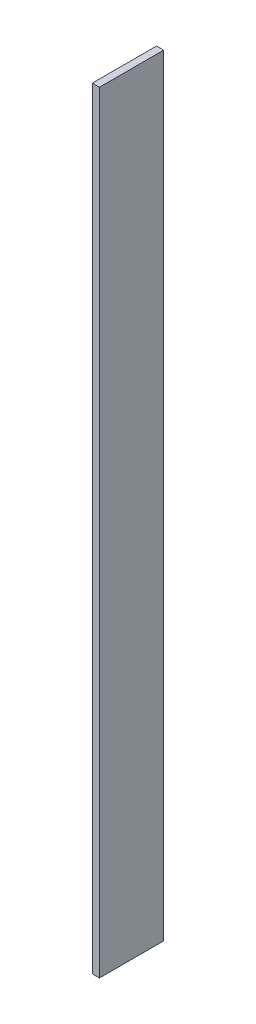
ISO-10303-21;
HEADER;
FILE_DESCRIPTION(('STEP AP214'),'2;1');
FILE_NAME('part.step','',(''),(''),'','','');
FILE_SCHEMA(('AUTOMOTIVE_DESIGN { 1 0 10303 214 1 1 1 1 }'));
ENDSEC;
DATA;
#1=APPLICATION_CONTEXT('core data for automotive mechanical design processes');
#2=APPLICATION_PROTOCOL_DEFINITION('international standard','automotive_design',2000,#1);
#3=PRODUCT_CONTEXT('',#1,'mechanical');
#4=PRODUCT('Part','Part','',(#3));
#5=PRODUCT_RELATED_PRODUCT_CATEGORY('part','',(#4));
#6=PRODUCT_DEFINITION_FORMATION('','',#4);
#7=PRODUCT_DEFINITION_CONTEXT('part definition',#1,'design');
#8=PRODUCT_DEFINITION('design','',#6,#7);
#9=PRODUCT_DEFINITION_SHAPE('','',#8);
#10=(LENGTH_UNIT() NAMED_UNIT(*) SI_UNIT(.MILLI.,.METRE.));
#11=(NAMED_UNIT(*) PLANE_ANGLE_UNIT() SI_UNIT($,.RADIAN.));
#12=(NAMED_UNIT(*) SI_UNIT($,.STERADIAN.) SOLID_ANGLE_UNIT());
#13=UNCERTAINTY_MEASURE_WITH_UNIT(LENGTH_MEASURE(1.E-05),#10,'distance_accuracy_value','');
#14=(GEOMETRIC_REPRESENTATION_CONTEXT(3) GLOBAL_UNCERTAINTY_ASSIGNED_CONTEXT((#13)) GLOBAL_UNIT_ASSIGNED_CONTEXT((#10,
#11,#12)) REPRESENTATION_CONTEXT('',''));
#15=CARTESIAN_POINT('',(0.,0.,0.));
#16=DIRECTION('',(0.,0.,1.));
#17=DIRECTION('',(1.,0.,0.));
#18=AXIS2_PLACEMENT_3D('',#15,#16,#17);
#19=CARTESIAN_POINT('',(-1015.,2503.40551440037,45.));
#20=DIRECTION('',(-1.,0.,0.));
#21=DIRECTION('',(0.,0.,1.));
#22=AXIS2_PLACEMENT_3D('',#19,#20,#21);
#23=PLANE('',#22);
#24=DIRECTION('',(0.,1.,0.));
#25=VECTOR('',#24,1.);
#26=CARTESIAN_POINT('',(-1015.,2503.40551440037,0.));
#27=LINE('',#26,#25);
#28=CARTESIAN_POINT('',(-1015.,1963.40551440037,0.));
#29=VERTEX_POINT('',#28);
#30=CARTESIAN_POINT('',(-1015.,2503.40551440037,0.));
#31=VERTEX_POINT('',#30);
#32=EDGE_CURVE('E68',#29,#31,#27,.T.);
#33=ORIENTED_EDGE('',*,*,#32,.T.);
#34=DIRECTION('',(0.,0.,-1.));
#35=VECTOR('',#34,1.);
#36=CARTESIAN_POINT('',(-1015.,2503.40551440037,45.));
#37=LINE('',#36,#35);
#38=CARTESIAN_POINT('',(-1015.,2503.40551440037,45.));
#39=VERTEX_POINT('',#38);
#40=EDGE_CURVE('E11',#39,#31,#37,.T.);
#41=ORIENTED_EDGE('',*,*,#40,.F.);
#42=DIRECTION('',(0.,1.,0.));
#43=VECTOR('',#42,1.);
#44=CARTESIAN_POINT('',(-1015.,2503.40551440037,45.));
#45=LINE('',#44,#43);
#46=CARTESIAN_POINT('',(-1015.,1963.40551440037,45.));
#47=VERTEX_POINT('',#46);
#48=EDGE_CURVE('E86',#47,#39,#45,.T.);
#49=ORIENTED_EDGE('',*,*,#48,.F.);
#50=DIRECTION('',(0.,0.,-1.));
#51=VECTOR('',#50,1.);
#52=CARTESIAN_POINT('',(-1015.,1963.40551440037,45.));
#53=LINE('',#52,#51);
#54=EDGE_CURVE('E80',#47,#29,#53,.T.);
#55=ORIENTED_EDGE('',*,*,#54,.T.);
#56=EDGE_LOOP('',(#33,#41,#49,#55));
#57=FACE_BOUND('',#56,.T.);
#58=ADVANCED_FACE('F24',(#57),#23,.F.);
#59=CARTESIAN_POINT('',(-1015.,2503.40551440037,45.));
#60=DIRECTION('',(0.,-1.,0.));
#61=DIRECTION('',(0.,0.,-1.));
#62=AXIS2_PLACEMENT_3D('',#59,#60,#61);
#63=PLANE('',#62);
#64=DIRECTION('',(-1.,0.,0.));
#65=VECTOR('',#64,1.);
#66=CARTESIAN_POINT('',(-1015.,2503.40551440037,0.));
#67=LINE('',#66,#65);
#68=CARTESIAN_POINT('',(-1020.,2503.40551440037,0.));
#69=VERTEX_POINT('',#68);
#70=EDGE_CURVE('E64',#31,#69,#67,.T.);
#71=ORIENTED_EDGE('',*,*,#70,.T.);
#72=DIRECTION('',(0.,0.,-1.));
#73=VECTOR('',#72,1.);
#74=CARTESIAN_POINT('',(-1020.,2503.40551440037,45.));
#75=LINE('',#74,#73);
#76=CARTESIAN_POINT('',(-1020.,2503.40551440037,45.));
#77=VERTEX_POINT('',#76);
#78=EDGE_CURVE('E31',#77,#69,#75,.T.);
#79=ORIENTED_EDGE('',*,*,#78,.F.);
#80=DIRECTION('',(-1.,0.,0.));
#81=VECTOR('',#80,1.);
#82=CARTESIAN_POINT('',(-1015.,2503.40551440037,45.));
#83=LINE('',#82,#81);
#84=EDGE_CURVE('E76',#39,#77,#83,.T.);
#85=ORIENTED_EDGE('',*,*,#84,.F.);
#86=ORIENTED_EDGE('',*,*,#40,.T.);
#87=EDGE_LOOP('',(#71,#79,#85,#86));
#88=FACE_BOUND('',#87,.T.);
#89=ADVANCED_FACE('F75',(#88),#63,.F.);
#90=CARTESIAN_POINT('',(-1020.,2503.40551440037,45.));
#91=DIRECTION('',(1.,0.,0.));
#92=DIRECTION('',(0.,0.,-1.));
#93=AXIS2_PLACEMENT_3D('',#90,#91,#92);
#94=PLANE('',#93);
#95=DIRECTION('',(0.,-1.,0.));
#96=VECTOR('',#95,1.);
#97=CARTESIAN_POINT('',(-1020.,2503.40551440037,0.));
#98=LINE('',#97,#96);
#99=CARTESIAN_POINT('',(-1020.,1963.40551440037,0.));
#100=VERTEX_POINT('',#99);
#101=EDGE_CURVE('E69',#69,#100,#98,.T.);
#102=ORIENTED_EDGE('',*,*,#101,.T.);
#103=DIRECTION('',(0.,0.,-1.));
#104=VECTOR('',#103,1.);
#105=CARTESIAN_POINT('',(-1020.,1963.40551440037,45.));
#106=LINE('',#105,#104);
#107=CARTESIAN_POINT('',(-1020.,1963.40551440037,45.));
#108=VERTEX_POINT('',#107);
#109=EDGE_CURVE('E92',#108,#100,#106,.T.);
#110=ORIENTED_EDGE('',*,*,#109,.F.);
#111=DIRECTION('',(0.,-1.,0.));
#112=VECTOR('',#111,1.);
#113=CARTESIAN_POINT('',(-1020.,2503.40551440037,45.));
#114=LINE('',#113,#112);
#115=EDGE_CURVE('E43',#77,#108,#114,.T.);
#116=ORIENTED_EDGE('',*,*,#115,.F.);
#117=ORIENTED_EDGE('',*,*,#78,.T.);
#118=EDGE_LOOP('',(#102,#110,#116,#117));
#119=FACE_BOUND('',#118,.T.);
#120=ADVANCED_FACE('F95',(#119),#94,.F.);
#121=CARTESIAN_POINT('',(-1015.,1963.40551440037,45.));
#122=DIRECTION('',(0.,1.,0.));
#123=DIRECTION('',(0.,0.,1.));
#124=AXIS2_PLACEMENT_3D('',#121,#122,#123);
#125=PLANE('',#124);
#126=DIRECTION('',(1.,0.,0.));
#127=VECTOR('',#126,1.);
#128=CARTESIAN_POINT('',(-1015.,1963.40551440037,0.));
#129=LINE('',#128,#127);
#130=EDGE_CURVE('E84',#100,#29,#129,.T.);
#131=ORIENTED_EDGE('',*,*,#130,.T.);
#132=ORIENTED_EDGE('',*,*,#54,.F.);
#133=DIRECTION('',(1.,0.,0.));
#134=VECTOR('',#133,1.);
#135=CARTESIAN_POINT('',(-1015.,1963.40551440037,45.));
#136=LINE('',#135,#134);
#137=EDGE_CURVE('E38',#108,#47,#136,.T.);
#138=ORIENTED_EDGE('',*,*,#137,.F.);
#139=ORIENTED_EDGE('',*,*,#109,.T.);
#140=EDGE_LOOP('',(#131,#132,#138,#139));
#141=FACE_BOUND('',#140,.T.);
#142=ADVANCED_FACE('F97',(#141),#125,.F.);
#143=CARTESIAN_POINT('',(-1015.,1963.40551440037,45.));
#144=DIRECTION('',(0.,0.,-1.));
#145=DIRECTION('',(-1.,0.,0.));
#146=AXIS2_PLACEMENT_3D('',#143,#144,#145);
#147=PLANE('',#146);
#148=ORIENTED_EDGE('',*,*,#48,.T.);
#149=ORIENTED_EDGE('',*,*,#84,.T.);
#150=ORIENTED_EDGE('',*,*,#115,.T.);
#151=ORIENTED_EDGE('',*,*,#137,.T.);
#152=EDGE_LOOP('',(#148,#149,#150,#151));
#153=FACE_BOUND('',#152,.T.);
#154=ADVANCED_FACE('F98',(#153),#147,.F.);
#155=CARTESIAN_POINT('',(-1015.,1963.40551440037,0.));
#156=DIRECTION('',(0.,0.,-1.));
#157=DIRECTION('',(-1.,0.,0.));
#158=AXIS2_PLACEMENT_3D('',#155,#156,#157);
#159=PLANE('',#158);
#160=ORIENTED_EDGE('',*,*,#32,.F.);
#161=ORIENTED_EDGE('',*,*,#130,.F.);
#162=ORIENTED_EDGE('',*,*,#101,.F.);
#163=ORIENTED_EDGE('',*,*,#70,.F.);
#164=EDGE_LOOP('',(#160,#161,#162,#163));
#165=FACE_BOUND('',#164,.T.);
#166=ADVANCED_FACE('F65',(#165),#159,.T.);
#167=CLOSED_SHELL('',(#58,#89,#120,#142,#154,#166));
#168=MANIFOLD_SOLID_BREP('B2',#167);
#169=ADVANCED_BREP_SHAPE_REPRESENTATION('',(#18,#168),#14);
#170=SHAPE_DEFINITION_REPRESENTATION(#9,#169);
ENDSEC;
END-ISO-10303-21;
